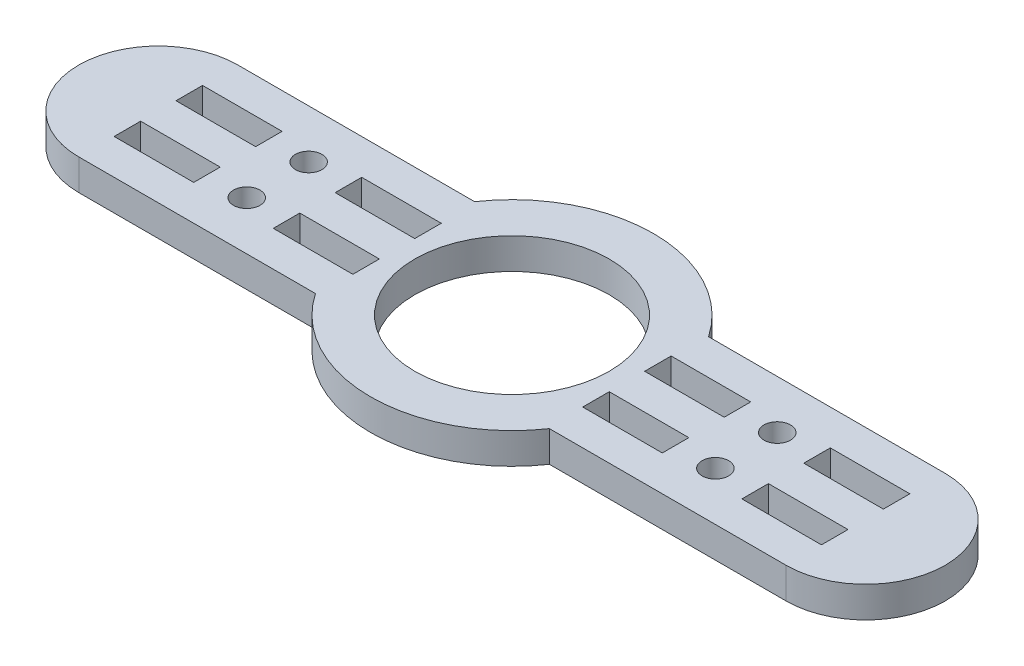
ISO-10303-21;
HEADER;
FILE_DESCRIPTION(('STEP AP214'),'2;1');
FILE_NAME('part.step','',(''),(''),'','','');
FILE_SCHEMA(('AUTOMOTIVE_DESIGN { 1 0 10303 214 1 1 1 1 }'));
ENDSEC;
DATA;
#1=APPLICATION_CONTEXT('core data for automotive mechanical design processes');
#2=APPLICATION_PROTOCOL_DEFINITION('international standard','automotive_design',2000,#1);
#3=PRODUCT_CONTEXT('',#1,'mechanical');
#4=PRODUCT('Part','Part','',(#3));
#5=PRODUCT_RELATED_PRODUCT_CATEGORY('part','',(#4));
#6=PRODUCT_DEFINITION_FORMATION('','',#4);
#7=PRODUCT_DEFINITION_CONTEXT('part definition',#1,'design');
#8=PRODUCT_DEFINITION('design','',#6,#7);
#9=PRODUCT_DEFINITION_SHAPE('','',#8);
#10=(LENGTH_UNIT() NAMED_UNIT(*) SI_UNIT(.MILLI.,.METRE.));
#11=(NAMED_UNIT(*) PLANE_ANGLE_UNIT() SI_UNIT($,.RADIAN.));
#12=(NAMED_UNIT(*) SI_UNIT($,.STERADIAN.) SOLID_ANGLE_UNIT());
#13=UNCERTAINTY_MEASURE_WITH_UNIT(LENGTH_MEASURE(1.E-05),#10,'distance_accuracy_value','');
#14=(GEOMETRIC_REPRESENTATION_CONTEXT(3) GLOBAL_UNCERTAINTY_ASSIGNED_CONTEXT((#13)) GLOBAL_UNIT_ASSIGNED_CONTEXT((#10,
#11,#12)) REPRESENTATION_CONTEXT('',''));
#15=CARTESIAN_POINT('',(0.,0.,0.));
#16=DIRECTION('',(0.,0.,1.));
#17=DIRECTION('',(1.,0.,0.));
#18=AXIS2_PLACEMENT_3D('',#15,#16,#17);
#19=CARTESIAN_POINT('',(31.,3.5,0.));
#20=DIRECTION('',(1.,0.,0.));
#21=DIRECTION('',(0.,0.,-1.));
#22=AXIS2_PLACEMENT_3D('',#19,#20,#21);
#23=PLANE('',#22);
#24=DIRECTION('',(0.,0.,1.));
#25=VECTOR('',#24,1.);
#26=CARTESIAN_POINT('',(31.,0.,0.));
#27=LINE('',#26,#25);
#28=CARTESIAN_POINT('',(31.,0.,-5.));
#29=VERTEX_POINT('',#28);
#30=CARTESIAN_POINT('',(31.,0.,-2.));
#31=VERTEX_POINT('',#30);
#32=EDGE_CURVE('E446',#29,#31,#27,.T.);
#33=ORIENTED_EDGE('',*,*,#32,.F.);
#34=DIRECTION('',(0.,-1.,0.));
#35=VECTOR('',#34,1.);
#36=CARTESIAN_POINT('',(31.,3.5,-5.));
#37=LINE('',#36,#35);
#38=CARTESIAN_POINT('',(31.,3.5,-5.));
#39=VERTEX_POINT('',#38);
#40=EDGE_CURVE('E11',#39,#29,#37,.T.);
#41=ORIENTED_EDGE('',*,*,#40,.F.);
#42=DIRECTION('',(0.,0.,1.));
#43=VECTOR('',#42,1.);
#44=CARTESIAN_POINT('',(31.,3.5,0.));
#45=LINE('',#44,#43);
#46=CARTESIAN_POINT('',(31.,3.5,-2.));
#47=VERTEX_POINT('',#46);
#48=EDGE_CURVE('E319',#39,#47,#45,.T.);
#49=ORIENTED_EDGE('',*,*,#48,.T.);
#50=DIRECTION('',(0.,-1.,0.));
#51=VECTOR('',#50,1.);
#52=CARTESIAN_POINT('',(31.,3.5,-2.));
#53=LINE('',#52,#51);
#54=EDGE_CURVE('E184',#47,#31,#53,.T.);
#55=ORIENTED_EDGE('',*,*,#54,.T.);
#56=EDGE_LOOP('',(#33,#41,#49,#55));
#57=FACE_BOUND('',#56,.T.);
#58=ADVANCED_FACE('F34',(#57),#23,.T.);
#59=CARTESIAN_POINT('',(0.,3.5,-5.));
#60=DIRECTION('',(0.,0.,1.));
#61=DIRECTION('',(1.,0.,0.));
#62=AXIS2_PLACEMENT_3D('',#59,#60,#61);
#63=PLANE('',#62);
#64=DIRECTION('',(-1.,0.,0.));
#65=VECTOR('',#64,1.);
#66=CARTESIAN_POINT('',(0.,0.,-5.));
#67=LINE('',#66,#65);
#68=CARTESIAN_POINT('',(40.,0.,-5.));
#69=VERTEX_POINT('',#68);
#70=EDGE_CURVE('E308',#69,#29,#67,.T.);
#71=ORIENTED_EDGE('',*,*,#70,.F.);
#72=DIRECTION('',(0.,-1.,0.));
#73=VECTOR('',#72,1.);
#74=CARTESIAN_POINT('',(40.,3.5,-5.));
#75=LINE('',#74,#73);
#76=CARTESIAN_POINT('',(40.,3.5,-5.));
#77=VERTEX_POINT('',#76);
#78=EDGE_CURVE('E44',#77,#69,#75,.T.);
#79=ORIENTED_EDGE('',*,*,#78,.F.);
#80=DIRECTION('',(-1.,0.,0.));
#81=VECTOR('',#80,1.);
#82=CARTESIAN_POINT('',(0.,3.5,-5.));
#83=LINE('',#82,#81);
#84=EDGE_CURVE('E306',#77,#39,#83,.T.);
#85=ORIENTED_EDGE('',*,*,#84,.T.);
#86=ORIENTED_EDGE('',*,*,#40,.T.);
#87=EDGE_LOOP('',(#71,#79,#85,#86));
#88=FACE_BOUND('',#87,.T.);
#89=ADVANCED_FACE('F304',(#88),#63,.T.);
#90=CARTESIAN_POINT('',(40.,3.5,0.));
#91=DIRECTION('',(1.,0.,0.));
#92=DIRECTION('',(0.,0.,-1.));
#93=AXIS2_PLACEMENT_3D('',#90,#91,#92);
#94=PLANE('',#93);
#95=DIRECTION('',(0.,0.,1.));
#96=VECTOR('',#95,1.);
#97=CARTESIAN_POINT('',(40.,0.,0.));
#98=LINE('',#97,#96);
#99=CARTESIAN_POINT('',(40.,0.,-2.));
#100=VERTEX_POINT('',#99);
#101=EDGE_CURVE('E449',#69,#100,#98,.T.);
#102=ORIENTED_EDGE('',*,*,#101,.T.);
#103=DIRECTION('',(0.,-1.,0.));
#104=VECTOR('',#103,1.);
#105=CARTESIAN_POINT('',(40.,3.5,-2.));
#106=LINE('',#105,#104);
#107=CARTESIAN_POINT('',(40.,3.5,-2.));
#108=VERTEX_POINT('',#107);
#109=EDGE_CURVE('E311',#108,#100,#106,.T.);
#110=ORIENTED_EDGE('',*,*,#109,.F.);
#111=DIRECTION('',(0.,0.,1.));
#112=VECTOR('',#111,1.);
#113=CARTESIAN_POINT('',(40.,3.5,0.));
#114=LINE('',#113,#112);
#115=EDGE_CURVE('E314',#77,#108,#114,.T.);
#116=ORIENTED_EDGE('',*,*,#115,.F.);
#117=ORIENTED_EDGE('',*,*,#78,.T.);
#118=EDGE_LOOP('',(#102,#110,#116,#117));
#119=FACE_BOUND('',#118,.T.);
#120=ADVANCED_FACE('F315',(#119),#94,.F.);
#121=CARTESIAN_POINT('',(13.,3.5,0.));
#122=DIRECTION('',(1.,0.,0.));
#123=DIRECTION('',(0.,0.,-1.));
#124=AXIS2_PLACEMENT_3D('',#121,#122,#123);
#125=PLANE('',#124);
#126=DIRECTION('',(0.,0.,1.));
#127=VECTOR('',#126,1.);
#128=CARTESIAN_POINT('',(13.,0.,0.));
#129=LINE('',#128,#127);
#130=CARTESIAN_POINT('',(13.,0.,-5.));
#131=VERTEX_POINT('',#130);
#132=CARTESIAN_POINT('',(13.,0.,-2.));
#133=VERTEX_POINT('',#132);
#134=EDGE_CURVE('E434',#131,#133,#129,.T.);
#135=ORIENTED_EDGE('',*,*,#134,.F.);
#136=DIRECTION('',(0.,-1.,0.));
#137=VECTOR('',#136,1.);
#138=CARTESIAN_POINT('',(13.,3.5,-5.));
#139=LINE('',#138,#137);
#140=CARTESIAN_POINT('',(13.,3.5,-5.));
#141=VERTEX_POINT('',#140);
#142=EDGE_CURVE('E457',#141,#131,#139,.T.);
#143=ORIENTED_EDGE('',*,*,#142,.F.);
#144=DIRECTION('',(0.,0.,1.));
#145=VECTOR('',#144,1.);
#146=CARTESIAN_POINT('',(13.,3.5,0.));
#147=LINE('',#146,#145);
#148=CARTESIAN_POINT('',(13.,3.5,-2.));
#149=VERTEX_POINT('',#148);
#150=EDGE_CURVE('E670',#141,#149,#147,.T.);
#151=ORIENTED_EDGE('',*,*,#150,.T.);
#152=DIRECTION('',(0.,-1.,0.));
#153=VECTOR('',#152,1.);
#154=CARTESIAN_POINT('',(13.,3.5,-2.));
#155=LINE('',#154,#153);
#156=EDGE_CURVE('E459',#149,#133,#155,.T.);
#157=ORIENTED_EDGE('',*,*,#156,.T.);
#158=EDGE_LOOP('',(#135,#143,#151,#157));
#159=FACE_BOUND('',#158,.T.);
#160=ADVANCED_FACE('F688',(#159),#125,.T.);
#161=CARTESIAN_POINT('',(0.,3.5,-5.));
#162=DIRECTION('',(0.,0.,1.));
#163=DIRECTION('',(1.,0.,0.));
#164=AXIS2_PLACEMENT_3D('',#161,#162,#163);
#165=PLANE('',#164);
#166=DIRECTION('',(-1.,0.,0.));
#167=VECTOR('',#166,1.);
#168=CARTESIAN_POINT('',(0.,0.,-5.));
#169=LINE('',#168,#167);
#170=CARTESIAN_POINT('',(22.,0.,-5.));
#171=VERTEX_POINT('',#170);
#172=EDGE_CURVE('E437',#171,#131,#169,.T.);
#173=ORIENTED_EDGE('',*,*,#172,.F.);
#174=DIRECTION('',(0.,-1.,0.));
#175=VECTOR('',#174,1.);
#176=CARTESIAN_POINT('',(22.,3.5,-5.));
#177=LINE('',#176,#175);
#178=CARTESIAN_POINT('',(22.,3.5,-5.));
#179=VERTEX_POINT('',#178);
#180=EDGE_CURVE('E465',#179,#171,#177,.T.);
#181=ORIENTED_EDGE('',*,*,#180,.F.);
#182=DIRECTION('',(-1.,0.,0.));
#183=VECTOR('',#182,1.);
#184=CARTESIAN_POINT('',(0.,3.5,-5.));
#185=LINE('',#184,#183);
#186=EDGE_CURVE('E673',#179,#141,#185,.T.);
#187=ORIENTED_EDGE('',*,*,#186,.T.);
#188=ORIENTED_EDGE('',*,*,#142,.T.);
#189=EDGE_LOOP('',(#173,#181,#187,#188));
#190=FACE_BOUND('',#189,.T.);
#191=ADVANCED_FACE('F691',(#190),#165,.T.);
#192=CARTESIAN_POINT('',(22.,3.5,0.));
#193=DIRECTION('',(1.,0.,0.));
#194=DIRECTION('',(0.,0.,-1.));
#195=AXIS2_PLACEMENT_3D('',#192,#193,#194);
#196=PLANE('',#195);
#197=DIRECTION('',(0.,0.,1.));
#198=VECTOR('',#197,1.);
#199=CARTESIAN_POINT('',(22.,0.,0.));
#200=LINE('',#199,#198);
#201=CARTESIAN_POINT('',(22.,0.,-2.));
#202=VERTEX_POINT('',#201);
#203=EDGE_CURVE('E440',#171,#202,#200,.T.);
#204=ORIENTED_EDGE('',*,*,#203,.T.);
#205=DIRECTION('',(0.,-1.,0.));
#206=VECTOR('',#205,1.);
#207=CARTESIAN_POINT('',(22.,3.5,-2.));
#208=LINE('',#207,#206);
#209=CARTESIAN_POINT('',(22.,3.5,-2.));
#210=VERTEX_POINT('',#209);
#211=EDGE_CURVE('E461',#210,#202,#208,.T.);
#212=ORIENTED_EDGE('',*,*,#211,.F.);
#213=DIRECTION('',(0.,0.,1.));
#214=VECTOR('',#213,1.);
#215=CARTESIAN_POINT('',(22.,3.5,0.));
#216=LINE('',#215,#214);
#217=EDGE_CURVE('E676',#179,#210,#216,.T.);
#218=ORIENTED_EDGE('',*,*,#217,.F.);
#219=ORIENTED_EDGE('',*,*,#180,.T.);
#220=EDGE_LOOP('',(#204,#212,#218,#219));
#221=FACE_BOUND('',#220,.T.);
#222=ADVANCED_FACE('F694',(#221),#196,.F.);
#223=CARTESIAN_POINT('',(40.,3.5,0.));
#224=DIRECTION('',(-1.,0.,0.));
#225=DIRECTION('',(0.,0.,1.));
#226=AXIS2_PLACEMENT_3D('',#223,#224,#225);
#227=PLANE('',#226);
#228=DIRECTION('',(0.,0.,-1.));
#229=VECTOR('',#228,1.);
#230=CARTESIAN_POINT('',(40.,0.,0.));
#231=LINE('',#230,#229);
#232=CARTESIAN_POINT('',(40.,0.,5.));
#233=VERTEX_POINT('',#232);
#234=CARTESIAN_POINT('',(40.,0.,2.));
#235=VERTEX_POINT('',#234);
#236=EDGE_CURVE('E422',#233,#235,#231,.T.);
#237=ORIENTED_EDGE('',*,*,#236,.F.);
#238=DIRECTION('',(0.,-1.,0.));
#239=VECTOR('',#238,1.);
#240=CARTESIAN_POINT('',(40.,3.5,5.));
#241=LINE('',#240,#239);
#242=CARTESIAN_POINT('',(40.,3.5,5.));
#243=VERTEX_POINT('',#242);
#244=EDGE_CURVE('E462',#243,#233,#241,.T.);
#245=ORIENTED_EDGE('',*,*,#244,.F.);
#246=DIRECTION('',(0.,0.,-1.));
#247=VECTOR('',#246,1.);
#248=CARTESIAN_POINT('',(40.,3.5,0.));
#249=LINE('',#248,#247);
#250=CARTESIAN_POINT('',(40.,3.5,2.));
#251=VERTEX_POINT('',#250);
#252=EDGE_CURVE('E659',#243,#251,#249,.T.);
#253=ORIENTED_EDGE('',*,*,#252,.T.);
#254=DIRECTION('',(0.,-1.,0.));
#255=VECTOR('',#254,1.);
#256=CARTESIAN_POINT('',(40.,3.5,2.));
#257=LINE('',#256,#255);
#258=EDGE_CURVE('E468',#251,#235,#257,.T.);
#259=ORIENTED_EDGE('',*,*,#258,.T.);
#260=EDGE_LOOP('',(#237,#245,#253,#259));
#261=FACE_BOUND('',#260,.T.);
#262=ADVANCED_FACE('F728',(#261),#227,.T.);
#263=CARTESIAN_POINT('',(0.,3.5,5.));
#264=DIRECTION('',(0.,0.,1.));
#265=DIRECTION('',(1.,0.,0.));
#266=AXIS2_PLACEMENT_3D('',#263,#264,#265);
#267=PLANE('',#266);
#268=DIRECTION('',(-1.,0.,0.));
#269=VECTOR('',#268,1.);
#270=CARTESIAN_POINT('',(0.,0.,5.));
#271=LINE('',#270,#269);
#272=CARTESIAN_POINT('',(31.,0.,5.));
#273=VERTEX_POINT('',#272);
#274=EDGE_CURVE('E425',#233,#273,#271,.T.);
#275=ORIENTED_EDGE('',*,*,#274,.T.);
#276=DIRECTION('',(0.,-1.,0.));
#277=VECTOR('',#276,1.);
#278=CARTESIAN_POINT('',(31.,3.5,5.));
#279=LINE('',#278,#277);
#280=CARTESIAN_POINT('',(31.,3.5,5.));
#281=VERTEX_POINT('',#280);
#282=EDGE_CURVE('E473',#281,#273,#279,.T.);
#283=ORIENTED_EDGE('',*,*,#282,.F.);
#284=DIRECTION('',(-1.,0.,0.));
#285=VECTOR('',#284,1.);
#286=CARTESIAN_POINT('',(0.,3.5,5.));
#287=LINE('',#286,#285);
#288=EDGE_CURVE('E662',#243,#281,#287,.T.);
#289=ORIENTED_EDGE('',*,*,#288,.F.);
#290=ORIENTED_EDGE('',*,*,#244,.T.);
#291=EDGE_LOOP('',(#275,#283,#289,#290));
#292=FACE_BOUND('',#291,.T.);
#293=ADVANCED_FACE('F741',(#292),#267,.F.);
#294=CARTESIAN_POINT('',(31.,3.5,0.));
#295=DIRECTION('',(-1.,0.,0.));
#296=DIRECTION('',(0.,0.,1.));
#297=AXIS2_PLACEMENT_3D('',#294,#295,#296);
#298=PLANE('',#297);
#299=DIRECTION('',(0.,0.,-1.));
#300=VECTOR('',#299,1.);
#301=CARTESIAN_POINT('',(31.,0.,0.));
#302=LINE('',#301,#300);
#303=CARTESIAN_POINT('',(31.,0.,2.));
#304=VERTEX_POINT('',#303);
#305=EDGE_CURVE('E428',#273,#304,#302,.T.);
#306=ORIENTED_EDGE('',*,*,#305,.T.);
#307=DIRECTION('',(0.,-1.,0.));
#308=VECTOR('',#307,1.);
#309=CARTESIAN_POINT('',(31.,3.5,2.));
#310=LINE('',#309,#308);
#311=CARTESIAN_POINT('',(31.,3.5,2.));
#312=VERTEX_POINT('',#311);
#313=EDGE_CURVE('E470',#312,#304,#310,.T.);
#314=ORIENTED_EDGE('',*,*,#313,.F.);
#315=DIRECTION('',(0.,0.,-1.));
#316=VECTOR('',#315,1.);
#317=CARTESIAN_POINT('',(31.,3.5,0.));
#318=LINE('',#317,#316);
#319=EDGE_CURVE('E665',#281,#312,#318,.T.);
#320=ORIENTED_EDGE('',*,*,#319,.F.);
#321=ORIENTED_EDGE('',*,*,#282,.T.);
#322=EDGE_LOOP('',(#306,#314,#320,#321));
#323=FACE_BOUND('',#322,.T.);
#324=ADVANCED_FACE('F737',(#323),#298,.F.);
#325=CARTESIAN_POINT('',(22.,3.5,0.));
#326=DIRECTION('',(-1.,0.,0.));
#327=DIRECTION('',(0.,0.,1.));
#328=AXIS2_PLACEMENT_3D('',#325,#326,#327);
#329=PLANE('',#328);
#330=DIRECTION('',(0.,0.,-1.));
#331=VECTOR('',#330,1.);
#332=CARTESIAN_POINT('',(22.,0.,0.));
#333=LINE('',#332,#331);
#334=CARTESIAN_POINT('',(22.,0.,5.));
#335=VERTEX_POINT('',#334);
#336=CARTESIAN_POINT('',(22.,0.,2.));
#337=VERTEX_POINT('',#336);
#338=EDGE_CURVE('E410',#335,#337,#333,.T.);
#339=ORIENTED_EDGE('',*,*,#338,.F.);
#340=DIRECTION('',(0.,-1.,0.));
#341=VECTOR('',#340,1.);
#342=CARTESIAN_POINT('',(22.,3.5,5.));
#343=LINE('',#342,#341);
#344=CARTESIAN_POINT('',(22.,3.5,5.));
#345=VERTEX_POINT('',#344);
#346=EDGE_CURVE('E471',#345,#335,#343,.T.);
#347=ORIENTED_EDGE('',*,*,#346,.F.);
#348=DIRECTION('',(0.,0.,-1.));
#349=VECTOR('',#348,1.);
#350=CARTESIAN_POINT('',(22.,3.5,0.));
#351=LINE('',#350,#349);
#352=CARTESIAN_POINT('',(22.,3.5,2.));
#353=VERTEX_POINT('',#352);
#354=EDGE_CURVE('E648',#345,#353,#351,.T.);
#355=ORIENTED_EDGE('',*,*,#354,.T.);
#356=DIRECTION('',(0.,-1.,0.));
#357=VECTOR('',#356,1.);
#358=CARTESIAN_POINT('',(22.,3.5,2.));
#359=LINE('',#358,#357);
#360=EDGE_CURVE('E477',#353,#337,#359,.T.);
#361=ORIENTED_EDGE('',*,*,#360,.T.);
#362=EDGE_LOOP('',(#339,#347,#355,#361));
#363=FACE_BOUND('',#362,.T.);
#364=ADVANCED_FACE('F740',(#363),#329,.T.);
#365=CARTESIAN_POINT('',(0.,3.5,5.));
#366=DIRECTION('',(0.,0.,1.));
#367=DIRECTION('',(1.,0.,0.));
#368=AXIS2_PLACEMENT_3D('',#365,#366,#367);
#369=PLANE('',#368);
#370=DIRECTION('',(-1.,0.,0.));
#371=VECTOR('',#370,1.);
#372=CARTESIAN_POINT('',(0.,0.,5.));
#373=LINE('',#372,#371);
#374=CARTESIAN_POINT('',(13.,0.,5.));
#375=VERTEX_POINT('',#374);
#376=EDGE_CURVE('E413',#335,#375,#373,.T.);
#377=ORIENTED_EDGE('',*,*,#376,.T.);
#378=DIRECTION('',(0.,-1.,0.));
#379=VECTOR('',#378,1.);
#380=CARTESIAN_POINT('',(13.,3.5,5.));
#381=LINE('',#380,#379);
#382=CARTESIAN_POINT('',(13.,3.5,5.));
#383=VERTEX_POINT('',#382);
#384=EDGE_CURVE('E482',#383,#375,#381,.T.);
#385=ORIENTED_EDGE('',*,*,#384,.F.);
#386=DIRECTION('',(-1.,0.,0.));
#387=VECTOR('',#386,1.);
#388=CARTESIAN_POINT('',(0.,3.5,5.));
#389=LINE('',#388,#387);
#390=EDGE_CURVE('E651',#345,#383,#389,.T.);
#391=ORIENTED_EDGE('',*,*,#390,.F.);
#392=ORIENTED_EDGE('',*,*,#346,.T.);
#393=EDGE_LOOP('',(#377,#385,#391,#392));
#394=FACE_BOUND('',#393,.T.);
#395=ADVANCED_FACE('F757',(#394),#369,.F.);
#396=CARTESIAN_POINT('',(13.,3.5,0.));
#397=DIRECTION('',(-1.,0.,0.));
#398=DIRECTION('',(0.,0.,1.));
#399=AXIS2_PLACEMENT_3D('',#396,#397,#398);
#400=PLANE('',#399);
#401=DIRECTION('',(0.,0.,-1.));
#402=VECTOR('',#401,1.);
#403=CARTESIAN_POINT('',(13.,0.,0.));
#404=LINE('',#403,#402);
#405=CARTESIAN_POINT('',(13.,0.,2.));
#406=VERTEX_POINT('',#405);
#407=EDGE_CURVE('E416',#375,#406,#404,.T.);
#408=ORIENTED_EDGE('',*,*,#407,.T.);
#409=DIRECTION('',(0.,-1.,0.));
#410=VECTOR('',#409,1.);
#411=CARTESIAN_POINT('',(13.,3.5,2.));
#412=LINE('',#411,#410);
#413=CARTESIAN_POINT('',(13.,3.5,2.));
#414=VERTEX_POINT('',#413);
#415=EDGE_CURVE('E479',#414,#406,#412,.T.);
#416=ORIENTED_EDGE('',*,*,#415,.F.);
#417=DIRECTION('',(0.,0.,-1.));
#418=VECTOR('',#417,1.);
#419=CARTESIAN_POINT('',(13.,3.5,0.));
#420=LINE('',#419,#418);
#421=EDGE_CURVE('E654',#383,#414,#420,.T.);
#422=ORIENTED_EDGE('',*,*,#421,.F.);
#423=ORIENTED_EDGE('',*,*,#384,.T.);
#424=EDGE_LOOP('',(#408,#416,#422,#423));
#425=FACE_BOUND('',#424,.T.);
#426=ADVANCED_FACE('F753',(#425),#400,.F.);
#427=CARTESIAN_POINT('',(-31.,3.5,0.));
#428=DIRECTION('',(-1.,0.,0.));
#429=DIRECTION('',(0.,0.,1.));
#430=AXIS2_PLACEMENT_3D('',#427,#428,#429);
#431=PLANE('',#430);
#432=DIRECTION('',(0.,0.,-1.));
#433=VECTOR('',#432,1.);
#434=CARTESIAN_POINT('',(-31.,0.,0.));
#435=LINE('',#434,#433);
#436=CARTESIAN_POINT('',(-31.,0.,5.));
#437=VERTEX_POINT('',#436);
#438=CARTESIAN_POINT('',(-31.,0.,2.));
#439=VERTEX_POINT('',#438);
#440=EDGE_CURVE('E392',#437,#439,#435,.T.);
#441=ORIENTED_EDGE('',*,*,#440,.F.);
#442=DIRECTION('',(0.,-1.,0.));
#443=VECTOR('',#442,1.);
#444=CARTESIAN_POINT('',(-31.,3.5,5.));
#445=LINE('',#444,#443);
#446=CARTESIAN_POINT('',(-31.,3.5,5.));
#447=VERTEX_POINT('',#446);
#448=EDGE_CURVE('E480',#447,#437,#445,.T.);
#449=ORIENTED_EDGE('',*,*,#448,.F.);
#450=DIRECTION('',(0.,0.,-1.));
#451=VECTOR('',#450,1.);
#452=CARTESIAN_POINT('',(-31.,3.5,0.));
#453=LINE('',#452,#451);
#454=CARTESIAN_POINT('',(-31.,3.5,2.));
#455=VERTEX_POINT('',#454);
#456=EDGE_CURVE('E631',#447,#455,#453,.T.);
#457=ORIENTED_EDGE('',*,*,#456,.T.);
#458=DIRECTION('',(0.,-1.,0.));
#459=VECTOR('',#458,1.);
#460=CARTESIAN_POINT('',(-31.,3.5,2.));
#461=LINE('',#460,#459);
#462=EDGE_CURVE('E486',#455,#439,#461,.T.);
#463=ORIENTED_EDGE('',*,*,#462,.T.);
#464=EDGE_LOOP('',(#441,#449,#457,#463));
#465=FACE_BOUND('',#464,.T.);
#466=ADVANCED_FACE('F756',(#465),#431,.T.);
#467=CARTESIAN_POINT('',(0.,3.5,5.));
#468=DIRECTION('',(0.,0.,-1.));
#469=DIRECTION('',(-1.,0.,0.));
#470=AXIS2_PLACEMENT_3D('',#467,#468,#469);
#471=PLANE('',#470);
#472=DIRECTION('',(1.,0.,0.));
#473=VECTOR('',#472,1.);
#474=CARTESIAN_POINT('',(0.,0.,5.));
#475=LINE('',#474,#473);
#476=CARTESIAN_POINT('',(-40.,0.,5.));
#477=VERTEX_POINT('',#476);
#478=EDGE_CURVE('E395',#477,#437,#475,.T.);
#479=ORIENTED_EDGE('',*,*,#478,.F.);
#480=DIRECTION('',(0.,-1.,0.));
#481=VECTOR('',#480,1.);
#482=CARTESIAN_POINT('',(-40.,3.5,5.));
#483=LINE('',#482,#481);
#484=CARTESIAN_POINT('',(-40.,3.5,5.));
#485=VERTEX_POINT('',#484);
#486=EDGE_CURVE('E492',#485,#477,#483,.T.);
#487=ORIENTED_EDGE('',*,*,#486,.F.);
#488=DIRECTION('',(1.,0.,0.));
#489=VECTOR('',#488,1.);
#490=CARTESIAN_POINT('',(0.,3.5,5.));
#491=LINE('',#490,#489);
#492=EDGE_CURVE('E634',#485,#447,#491,.T.);
#493=ORIENTED_EDGE('',*,*,#492,.T.);
#494=ORIENTED_EDGE('',*,*,#448,.T.);
#495=EDGE_LOOP('',(#479,#487,#493,#494));
#496=FACE_BOUND('',#495,.T.);
#497=ADVANCED_FACE('F781',(#496),#471,.T.);
#498=CARTESIAN_POINT('',(-40.,3.5,0.));
#499=DIRECTION('',(-1.,0.,0.));
#500=DIRECTION('',(0.,0.,1.));
#501=AXIS2_PLACEMENT_3D('',#498,#499,#500);
#502=PLANE('',#501);
#503=DIRECTION('',(0.,0.,-1.));
#504=VECTOR('',#503,1.);
#505=CARTESIAN_POINT('',(-40.,0.,0.));
#506=LINE('',#505,#504);
#507=CARTESIAN_POINT('',(-40.,0.,2.));
#508=VERTEX_POINT('',#507);
#509=EDGE_CURVE('E398',#477,#508,#506,.T.);
#510=ORIENTED_EDGE('',*,*,#509,.T.);
#511=DIRECTION('',(0.,-1.,0.));
#512=VECTOR('',#511,1.);
#513=CARTESIAN_POINT('',(-40.,3.5,2.));
#514=LINE('',#513,#512);
#515=CARTESIAN_POINT('',(-40.,3.5,2.));
#516=VERTEX_POINT('',#515);
#517=EDGE_CURVE('E488',#516,#508,#514,.T.);
#518=ORIENTED_EDGE('',*,*,#517,.F.);
#519=DIRECTION('',(0.,0.,-1.));
#520=VECTOR('',#519,1.);
#521=CARTESIAN_POINT('',(-40.,3.5,0.));
#522=LINE('',#521,#520);
#523=EDGE_CURVE('E637',#485,#516,#522,.T.);
#524=ORIENTED_EDGE('',*,*,#523,.F.);
#525=ORIENTED_EDGE('',*,*,#486,.T.);
#526=EDGE_LOOP('',(#510,#518,#524,#525));
#527=FACE_BOUND('',#526,.T.);
#528=ADVANCED_FACE('F777',(#527),#502,.F.);
#529=CARTESIAN_POINT('',(-13.,3.5,0.));
#530=DIRECTION('',(-1.,0.,0.));
#531=DIRECTION('',(0.,0.,1.));
#532=AXIS2_PLACEMENT_3D('',#529,#530,#531);
#533=PLANE('',#532);
#534=DIRECTION('',(0.,0.,-1.));
#535=VECTOR('',#534,1.);
#536=CARTESIAN_POINT('',(-13.,0.,0.));
#537=LINE('',#536,#535);
#538=CARTESIAN_POINT('',(-13.,0.,5.));
#539=VERTEX_POINT('',#538);
#540=CARTESIAN_POINT('',(-13.,0.,2.));
#541=VERTEX_POINT('',#540);
#542=EDGE_CURVE('E380',#539,#541,#537,.T.);
#543=ORIENTED_EDGE('',*,*,#542,.F.);
#544=DIRECTION('',(0.,-1.,0.));
#545=VECTOR('',#544,1.);
#546=CARTESIAN_POINT('',(-13.,3.5,5.));
#547=LINE('',#546,#545);
#548=CARTESIAN_POINT('',(-13.,3.5,5.));
#549=VERTEX_POINT('',#548);
#550=EDGE_CURVE('E489',#549,#539,#547,.T.);
#551=ORIENTED_EDGE('',*,*,#550,.F.);
#552=DIRECTION('',(0.,0.,-1.));
#553=VECTOR('',#552,1.);
#554=CARTESIAN_POINT('',(-13.,3.5,0.));
#555=LINE('',#554,#553);
#556=CARTESIAN_POINT('',(-13.,3.5,2.));
#557=VERTEX_POINT('',#556);
#558=EDGE_CURVE('E620',#549,#557,#555,.T.);
#559=ORIENTED_EDGE('',*,*,#558,.T.);
#560=DIRECTION('',(0.,-1.,0.));
#561=VECTOR('',#560,1.);
#562=CARTESIAN_POINT('',(-13.,3.5,2.));
#563=LINE('',#562,#561);
#564=EDGE_CURVE('E495',#557,#541,#563,.T.);
#565=ORIENTED_EDGE('',*,*,#564,.T.);
#566=EDGE_LOOP('',(#543,#551,#559,#565));
#567=FACE_BOUND('',#566,.T.);
#568=ADVANCED_FACE('F780',(#567),#533,.T.);
#569=CARTESIAN_POINT('',(0.,3.5,5.));
#570=DIRECTION('',(0.,0.,-1.));
#571=DIRECTION('',(-1.,0.,0.));
#572=AXIS2_PLACEMENT_3D('',#569,#570,#571);
#573=PLANE('',#572);
#574=DIRECTION('',(1.,0.,0.));
#575=VECTOR('',#574,1.);
#576=CARTESIAN_POINT('',(0.,0.,5.));
#577=LINE('',#576,#575);
#578=CARTESIAN_POINT('',(-22.,0.,5.));
#579=VERTEX_POINT('',#578);
#580=EDGE_CURVE('E383',#579,#539,#577,.T.);
#581=ORIENTED_EDGE('',*,*,#580,.F.);
#582=DIRECTION('',(0.,-1.,0.));
#583=VECTOR('',#582,1.);
#584=CARTESIAN_POINT('',(-22.,3.5,5.));
#585=LINE('',#584,#583);
#586=CARTESIAN_POINT('',(-22.,3.5,5.));
#587=VERTEX_POINT('',#586);
#588=EDGE_CURVE('E501',#587,#579,#585,.T.);
#589=ORIENTED_EDGE('',*,*,#588,.F.);
#590=DIRECTION('',(1.,0.,0.));
#591=VECTOR('',#590,1.);
#592=CARTESIAN_POINT('',(0.,3.5,5.));
#593=LINE('',#592,#591);
#594=EDGE_CURVE('E623',#587,#549,#593,.T.);
#595=ORIENTED_EDGE('',*,*,#594,.T.);
#596=ORIENTED_EDGE('',*,*,#550,.T.);
#597=EDGE_LOOP('',(#581,#589,#595,#596));
#598=FACE_BOUND('',#597,.T.);
#599=ADVANCED_FACE('F797',(#598),#573,.T.);
#600=CARTESIAN_POINT('',(-22.,3.5,0.));
#601=DIRECTION('',(-1.,0.,0.));
#602=DIRECTION('',(0.,0.,1.));
#603=AXIS2_PLACEMENT_3D('',#600,#601,#602);
#604=PLANE('',#603);
#605=DIRECTION('',(0.,0.,-1.));
#606=VECTOR('',#605,1.);
#607=CARTESIAN_POINT('',(-22.,0.,0.));
#608=LINE('',#607,#606);
#609=CARTESIAN_POINT('',(-22.,0.,2.));
#610=VERTEX_POINT('',#609);
#611=EDGE_CURVE('E386',#579,#610,#608,.T.);
#612=ORIENTED_EDGE('',*,*,#611,.T.);
#613=DIRECTION('',(0.,-1.,0.));
#614=VECTOR('',#613,1.);
#615=CARTESIAN_POINT('',(-22.,3.5,2.));
#616=LINE('',#615,#614);
#617=CARTESIAN_POINT('',(-22.,3.5,2.));
#618=VERTEX_POINT('',#617);
#619=EDGE_CURVE('E497',#618,#610,#616,.T.);
#620=ORIENTED_EDGE('',*,*,#619,.F.);
#621=DIRECTION('',(0.,0.,-1.));
#622=VECTOR('',#621,1.);
#623=CARTESIAN_POINT('',(-22.,3.5,0.));
#624=LINE('',#623,#622);
#625=EDGE_CURVE('E626',#587,#618,#624,.T.);
#626=ORIENTED_EDGE('',*,*,#625,.F.);
#627=ORIENTED_EDGE('',*,*,#588,.T.);
#628=EDGE_LOOP('',(#612,#620,#626,#627));
#629=FACE_BOUND('',#628,.T.);
#630=ADVANCED_FACE('F793',(#629),#604,.F.);
#631=CARTESIAN_POINT('',(-40.,3.5,0.));
#632=DIRECTION('',(1.,0.,0.));
#633=DIRECTION('',(0.,0.,-1.));
#634=AXIS2_PLACEMENT_3D('',#631,#632,#633);
#635=PLANE('',#634);
#636=DIRECTION('',(0.,0.,1.));
#637=VECTOR('',#636,1.);
#638=CARTESIAN_POINT('',(-40.,0.,0.));
#639=LINE('',#638,#637);
#640=CARTESIAN_POINT('',(-40.,0.,-5.));
#641=VERTEX_POINT('',#640);
#642=CARTESIAN_POINT('',(-40.,0.,-2.));
#643=VERTEX_POINT('',#642);
#644=EDGE_CURVE('E368',#641,#643,#639,.T.);
#645=ORIENTED_EDGE('',*,*,#644,.F.);
#646=DIRECTION('',(0.,-1.,0.));
#647=VECTOR('',#646,1.);
#648=CARTESIAN_POINT('',(-40.,3.5,-5.));
#649=LINE('',#648,#647);
#650=CARTESIAN_POINT('',(-40.,3.5,-5.));
#651=VERTEX_POINT('',#650);
#652=EDGE_CURVE('E498',#651,#641,#649,.T.);
#653=ORIENTED_EDGE('',*,*,#652,.F.);
#654=DIRECTION('',(0.,0.,1.));
#655=VECTOR('',#654,1.);
#656=CARTESIAN_POINT('',(-40.,3.5,0.));
#657=LINE('',#656,#655);
#658=CARTESIAN_POINT('',(-40.,3.5,-2.));
#659=VERTEX_POINT('',#658);
#660=EDGE_CURVE('E609',#651,#659,#657,.T.);
#661=ORIENTED_EDGE('',*,*,#660,.T.);
#662=DIRECTION('',(0.,-1.,0.));
#663=VECTOR('',#662,1.);
#664=CARTESIAN_POINT('',(-40.,3.5,-2.));
#665=LINE('',#664,#663);
#666=EDGE_CURVE('E504',#659,#643,#665,.T.);
#667=ORIENTED_EDGE('',*,*,#666,.T.);
#668=EDGE_LOOP('',(#645,#653,#661,#667));
#669=FACE_BOUND('',#668,.T.);
#670=ADVANCED_FACE('F796',(#669),#635,.T.);
#671=CARTESIAN_POINT('',(0.,3.5,-5.));
#672=DIRECTION('',(0.,0.,-1.));
#673=DIRECTION('',(-1.,0.,0.));
#674=AXIS2_PLACEMENT_3D('',#671,#672,#673);
#675=PLANE('',#674);
#676=DIRECTION('',(1.,0.,0.));
#677=VECTOR('',#676,1.);
#678=CARTESIAN_POINT('',(0.,0.,-5.));
#679=LINE('',#678,#677);
#680=CARTESIAN_POINT('',(-31.,0.,-5.));
#681=VERTEX_POINT('',#680);
#682=EDGE_CURVE('E371',#641,#681,#679,.T.);
#683=ORIENTED_EDGE('',*,*,#682,.T.);
#684=DIRECTION('',(0.,-1.,0.));
#685=VECTOR('',#684,1.);
#686=CARTESIAN_POINT('',(-31.,3.5,-5.));
#687=LINE('',#686,#685);
#688=CARTESIAN_POINT('',(-31.,3.5,-5.));
#689=VERTEX_POINT('',#688);
#690=EDGE_CURVE('E509',#689,#681,#687,.T.);
#691=ORIENTED_EDGE('',*,*,#690,.F.);
#692=DIRECTION('',(1.,0.,0.));
#693=VECTOR('',#692,1.);
#694=CARTESIAN_POINT('',(0.,3.5,-5.));
#695=LINE('',#694,#693);
#696=EDGE_CURVE('E612',#651,#689,#695,.T.);
#697=ORIENTED_EDGE('',*,*,#696,.F.);
#698=ORIENTED_EDGE('',*,*,#652,.T.);
#699=EDGE_LOOP('',(#683,#691,#697,#698));
#700=FACE_BOUND('',#699,.T.);
#701=ADVANCED_FACE('F813',(#700),#675,.F.);
#702=CARTESIAN_POINT('',(-31.,3.5,0.));
#703=DIRECTION('',(1.,0.,0.));
#704=DIRECTION('',(0.,0.,-1.));
#705=AXIS2_PLACEMENT_3D('',#702,#703,#704);
#706=PLANE('',#705);
#707=DIRECTION('',(0.,0.,1.));
#708=VECTOR('',#707,1.);
#709=CARTESIAN_POINT('',(-31.,0.,0.));
#710=LINE('',#709,#708);
#711=CARTESIAN_POINT('',(-31.,0.,-2.));
#712=VERTEX_POINT('',#711);
#713=EDGE_CURVE('E374',#681,#712,#710,.T.);
#714=ORIENTED_EDGE('',*,*,#713,.T.);
#715=DIRECTION('',(0.,-1.,0.));
#716=VECTOR('',#715,1.);
#717=CARTESIAN_POINT('',(-31.,3.5,-2.));
#718=LINE('',#717,#716);
#719=CARTESIAN_POINT('',(-31.,3.5,-2.));
#720=VERTEX_POINT('',#719);
#721=EDGE_CURVE('E506',#720,#712,#718,.T.);
#722=ORIENTED_EDGE('',*,*,#721,.F.);
#723=DIRECTION('',(0.,0.,1.));
#724=VECTOR('',#723,1.);
#725=CARTESIAN_POINT('',(-31.,3.5,0.));
#726=LINE('',#725,#724);
#727=EDGE_CURVE('E615',#689,#720,#726,.T.);
#728=ORIENTED_EDGE('',*,*,#727,.F.);
#729=ORIENTED_EDGE('',*,*,#690,.T.);
#730=EDGE_LOOP('',(#714,#722,#728,#729));
#731=FACE_BOUND('',#730,.T.);
#732=ADVANCED_FACE('F809',(#731),#706,.F.);
#733=CARTESIAN_POINT('',(-22.,3.5,0.));
#734=DIRECTION('',(1.,0.,0.));
#735=DIRECTION('',(0.,0.,-1.));
#736=AXIS2_PLACEMENT_3D('',#733,#734,#735);
#737=PLANE('',#736);
#738=DIRECTION('',(0.,0.,1.));
#739=VECTOR('',#738,1.);
#740=CARTESIAN_POINT('',(-22.,0.,0.));
#741=LINE('',#740,#739);
#742=CARTESIAN_POINT('',(-22.,0.,-5.));
#743=VERTEX_POINT('',#742);
#744=CARTESIAN_POINT('',(-22.,0.,-2.));
#745=VERTEX_POINT('',#744);
#746=EDGE_CURVE('E356',#743,#745,#741,.T.);
#747=ORIENTED_EDGE('',*,*,#746,.F.);
#748=DIRECTION('',(0.,-1.,0.));
#749=VECTOR('',#748,1.);
#750=CARTESIAN_POINT('',(-22.,3.5,-5.));
#751=LINE('',#750,#749);
#752=CARTESIAN_POINT('',(-22.,3.5,-5.));
#753=VERTEX_POINT('',#752);
#754=EDGE_CURVE('E507',#753,#743,#751,.T.);
#755=ORIENTED_EDGE('',*,*,#754,.F.);
#756=DIRECTION('',(0.,0.,1.));
#757=VECTOR('',#756,1.);
#758=CARTESIAN_POINT('',(-22.,3.5,0.));
#759=LINE('',#758,#757);
#760=CARTESIAN_POINT('',(-22.,3.5,-2.));
#761=VERTEX_POINT('',#760);
#762=EDGE_CURVE('E598',#753,#761,#759,.T.);
#763=ORIENTED_EDGE('',*,*,#762,.T.);
#764=DIRECTION('',(0.,-1.,0.));
#765=VECTOR('',#764,1.);
#766=CARTESIAN_POINT('',(-22.,3.5,-2.));
#767=LINE('',#766,#765);
#768=EDGE_CURVE('E513',#761,#745,#767,.T.);
#769=ORIENTED_EDGE('',*,*,#768,.T.);
#770=EDGE_LOOP('',(#747,#755,#763,#769));
#771=FACE_BOUND('',#770,.T.);
#772=ADVANCED_FACE('F812',(#771),#737,.T.);
#773=CARTESIAN_POINT('',(0.,3.5,-5.));
#774=DIRECTION('',(0.,0.,-1.));
#775=DIRECTION('',(-1.,0.,0.));
#776=AXIS2_PLACEMENT_3D('',#773,#774,#775);
#777=PLANE('',#776);
#778=DIRECTION('',(1.,0.,0.));
#779=VECTOR('',#778,1.);
#780=CARTESIAN_POINT('',(0.,0.,-5.));
#781=LINE('',#780,#779);
#782=CARTESIAN_POINT('',(-13.,0.,-5.));
#783=VERTEX_POINT('',#782);
#784=EDGE_CURVE('E359',#743,#783,#781,.T.);
#785=ORIENTED_EDGE('',*,*,#784,.T.);
#786=DIRECTION('',(0.,-1.,0.));
#787=VECTOR('',#786,1.);
#788=CARTESIAN_POINT('',(-13.,3.5,-5.));
#789=LINE('',#788,#787);
#790=CARTESIAN_POINT('',(-13.,3.5,-5.));
#791=VERTEX_POINT('',#790);
#792=EDGE_CURVE('E517',#791,#783,#789,.T.);
#793=ORIENTED_EDGE('',*,*,#792,.F.);
#794=DIRECTION('',(1.,0.,0.));
#795=VECTOR('',#794,1.);
#796=CARTESIAN_POINT('',(0.,3.5,-5.));
#797=LINE('',#796,#795);
#798=EDGE_CURVE('E601',#753,#791,#797,.T.);
#799=ORIENTED_EDGE('',*,*,#798,.F.);
#800=ORIENTED_EDGE('',*,*,#754,.T.);
#801=EDGE_LOOP('',(#785,#793,#799,#800));
#802=FACE_BOUND('',#801,.T.);
#803=ADVANCED_FACE('F828',(#802),#777,.F.);
#804=CARTESIAN_POINT('',(-13.,3.5,0.));
#805=DIRECTION('',(1.,0.,0.));
#806=DIRECTION('',(0.,0.,-1.));
#807=AXIS2_PLACEMENT_3D('',#804,#805,#806);
#808=PLANE('',#807);
#809=DIRECTION('',(0.,0.,1.));
#810=VECTOR('',#809,1.);
#811=CARTESIAN_POINT('',(-13.,0.,0.));
#812=LINE('',#811,#810);
#813=CARTESIAN_POINT('',(-13.,0.,-2.));
#814=VERTEX_POINT('',#813);
#815=EDGE_CURVE('E362',#783,#814,#812,.T.);
#816=ORIENTED_EDGE('',*,*,#815,.T.);
#817=DIRECTION('',(0.,-1.,0.));
#818=VECTOR('',#817,1.);
#819=CARTESIAN_POINT('',(-13.,3.5,-2.));
#820=LINE('',#819,#818);
#821=CARTESIAN_POINT('',(-13.,3.5,-2.));
#822=VERTEX_POINT('',#821);
#823=EDGE_CURVE('E515',#822,#814,#820,.T.);
#824=ORIENTED_EDGE('',*,*,#823,.F.);
#825=DIRECTION('',(0.,0.,1.));
#826=VECTOR('',#825,1.);
#827=CARTESIAN_POINT('',(-13.,3.5,0.));
#828=LINE('',#827,#826);
#829=EDGE_CURVE('E604',#791,#822,#828,.T.);
#830=ORIENTED_EDGE('',*,*,#829,.F.);
#831=ORIENTED_EDGE('',*,*,#792,.T.);
#832=EDGE_LOOP('',(#816,#824,#830,#831));
#833=FACE_BOUND('',#832,.T.);
#834=ADVANCED_FACE('F825',(#833),#808,.F.);
#835=CARTESIAN_POINT('',(0.,3.5,-9.00000000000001));
#836=DIRECTION('',(0.,0.,-1.));
#837=DIRECTION('',(-1.,0.,0.));
#838=AXIS2_PLACEMENT_3D('',#835,#836,#837);
#839=PLANE('',#838);
#840=DIRECTION('',(1.,0.,0.));
#841=VECTOR('',#840,1.);
#842=CARTESIAN_POINT('',(0.,0.,-9.00000000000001));
#843=LINE('',#842,#841);
#844=CARTESIAN_POINT('',(13.2287565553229,0.,-9.00000000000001));
#845=VERTEX_POINT('',#844);
#846=CARTESIAN_POINT('',(40.,0.,-9.00000000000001));
#847=VERTEX_POINT('',#846);
#848=EDGE_CURVE('E330',#845,#847,#843,.T.);
#849=ORIENTED_EDGE('',*,*,#848,.F.);
#850=DIRECTION('',(0.,-1.,0.));
#851=VECTOR('',#850,1.);
#852=CARTESIAN_POINT('',(13.2287565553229,3.5,-9.00000000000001));
#853=LINE('',#852,#851);
#854=CARTESIAN_POINT('',(13.2287565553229,3.5,-9.00000000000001));
#855=VERTEX_POINT('',#854);
#856=EDGE_CURVE('E38',#855,#845,#853,.T.);
#857=ORIENTED_EDGE('',*,*,#856,.F.);
#858=DIRECTION('',(1.,0.,0.));
#859=VECTOR('',#858,1.);
#860=CARTESIAN_POINT('',(0.,3.5,-9.00000000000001));
#861=LINE('',#860,#859);
#862=CARTESIAN_POINT('',(40.,3.5,-9.00000000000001));
#863=VERTEX_POINT('',#862);
#864=EDGE_CURVE('E455',#855,#863,#861,.T.);
#865=ORIENTED_EDGE('',*,*,#864,.T.);
#866=DIRECTION('',(0.,-1.,0.));
#867=VECTOR('',#866,1.);
#868=CARTESIAN_POINT('',(40.,3.5,-9.00000000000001));
#869=LINE('',#868,#867);
#870=EDGE_CURVE('E329',#863,#847,#869,.T.);
#871=ORIENTED_EDGE('',*,*,#870,.T.);
#872=EDGE_LOOP('',(#849,#857,#865,#871));
#873=FACE_BOUND('',#872,.T.);
#874=ADVANCED_FACE('F36',(#873),#839,.T.);
#875=CARTESIAN_POINT('',(0.,3.5,0.));
#876=DIRECTION('',(0.,-1.,0.));
#877=DIRECTION('',(0.,0.,-1.));
#878=AXIS2_PLACEMENT_3D('',#875,#876,#877);
#879=CYLINDRICAL_SURFACE('',#878,16.);
#880=CARTESIAN_POINT('',(0.,0.,0.));
#881=DIRECTION('',(0.,1.,0.));
#882=DIRECTION('',(0.,0.,1.));
#883=AXIS2_PLACEMENT_3D('',#880,#881,#882);
#884=CIRCLE('',#883,16.);
#885=CARTESIAN_POINT('',(-13.228756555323,0.,-9.00000000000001));
#886=VERTEX_POINT('',#885);
#887=EDGE_CURVE('E333',#845,#886,#884,.T.);
#888=ORIENTED_EDGE('',*,*,#887,.T.);
#889=DIRECTION('',(0.,-1.,0.));
#890=VECTOR('',#889,1.);
#891=CARTESIAN_POINT('',(-13.228756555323,3.5,-9.00000000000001));
#892=LINE('',#891,#890);
#893=CARTESIAN_POINT('',(-13.228756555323,3.5,-9.00000000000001));
#894=VERTEX_POINT('',#893);
#895=EDGE_CURVE('E535',#894,#886,#892,.T.);
#896=ORIENTED_EDGE('',*,*,#895,.F.);
#897=CARTESIAN_POINT('',(0.,3.5,0.));
#898=DIRECTION('',(0.,1.,0.));
#899=DIRECTION('',(0.,0.,1.));
#900=AXIS2_PLACEMENT_3D('',#897,#898,#899);
#901=CIRCLE('',#900,16.);
#902=EDGE_CURVE('E543',#855,#894,#901,.T.);
#903=ORIENTED_EDGE('',*,*,#902,.F.);
#904=ORIENTED_EDGE('',*,*,#856,.T.);
#905=EDGE_LOOP('',(#888,#896,#903,#904));
#906=FACE_BOUND('',#905,.T.);
#907=ADVANCED_FACE('F542',(#906),#879,.T.);
#908=CARTESIAN_POINT('',(0.,3.5,-9.00000000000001));
#909=DIRECTION('',(0.,0.,-1.));
#910=DIRECTION('',(-1.,0.,0.));
#911=AXIS2_PLACEMENT_3D('',#908,#909,#910);
#912=PLANE('',#911);
#913=DIRECTION('',(1.,0.,0.));
#914=VECTOR('',#913,1.);
#915=CARTESIAN_POINT('',(0.,0.,-9.00000000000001));
#916=LINE('',#915,#914);
#917=CARTESIAN_POINT('',(-40.,0.,-9.));
#918=VERTEX_POINT('',#917);
#919=EDGE_CURVE('E336',#918,#886,#916,.T.);
#920=ORIENTED_EDGE('',*,*,#919,.F.);
#921=DIRECTION('',(0.,-1.,0.));
#922=VECTOR('',#921,1.);
#923=CARTESIAN_POINT('',(-40.,3.5,-9.));
#924=LINE('',#923,#922);
#925=CARTESIAN_POINT('',(-40.,3.5,-9.));
#926=VERTEX_POINT('',#925);
#927=EDGE_CURVE('E534',#926,#918,#924,.T.);
#928=ORIENTED_EDGE('',*,*,#927,.F.);
#929=DIRECTION('',(1.,0.,0.));
#930=VECTOR('',#929,1.);
#931=CARTESIAN_POINT('',(0.,3.5,-9.00000000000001));
#932=LINE('',#931,#930);
#933=EDGE_CURVE('E577',#926,#894,#932,.T.);
#934=ORIENTED_EDGE('',*,*,#933,.T.);
#935=ORIENTED_EDGE('',*,*,#895,.T.);
#936=EDGE_LOOP('',(#920,#928,#934,#935));
#937=FACE_BOUND('',#936,.T.);
#938=ADVANCED_FACE('F574',(#937),#912,.T.);
#939=CARTESIAN_POINT('',(-40.,3.5,0.));
#940=DIRECTION('',(0.,-1.,0.));
#941=DIRECTION('',(0.,0.,-1.));
#942=AXIS2_PLACEMENT_3D('',#939,#940,#941);
#943=CYLINDRICAL_SURFACE('',#942,9.);
#944=CARTESIAN_POINT('',(-40.,0.,0.));
#945=DIRECTION('',(0.,1.,0.));
#946=DIRECTION('',(0.,0.,1.));
#947=AXIS2_PLACEMENT_3D('',#944,#945,#946);
#948=CIRCLE('',#947,9.);
#949=CARTESIAN_POINT('',(-40.,0.,9.));
#950=VERTEX_POINT('',#949);
#951=EDGE_CURVE('E339',#918,#950,#948,.T.);
#952=ORIENTED_EDGE('',*,*,#951,.T.);
#953=DIRECTION('',(0.,-1.,0.));
#954=VECTOR('',#953,1.);
#955=CARTESIAN_POINT('',(-40.,3.5,9.));
#956=LINE('',#955,#954);
#957=CARTESIAN_POINT('',(-40.,3.5,9.));
#958=VERTEX_POINT('',#957);
#959=EDGE_CURVE('E531',#958,#950,#956,.T.);
#960=ORIENTED_EDGE('',*,*,#959,.F.);
#961=CARTESIAN_POINT('',(-40.,3.5,0.));
#962=DIRECTION('',(0.,1.,0.));
#963=DIRECTION('',(0.,0.,1.));
#964=AXIS2_PLACEMENT_3D('',#961,#962,#963);
#965=CIRCLE('',#964,9.);
#966=EDGE_CURVE('E578',#926,#958,#965,.T.);
#967=ORIENTED_EDGE('',*,*,#966,.F.);
#968=ORIENTED_EDGE('',*,*,#927,.T.);
#969=EDGE_LOOP('',(#952,#960,#967,#968));
#970=FACE_BOUND('',#969,.T.);
#971=ADVANCED_FACE('F579',(#970),#943,.T.);
#972=CARTESIAN_POINT('',(0.,3.5,8.99999999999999));
#973=DIRECTION('',(0.,0.,-1.));
#974=DIRECTION('',(-1.,0.,0.));
#975=AXIS2_PLACEMENT_3D('',#972,#973,#974);
#976=PLANE('',#975);
#977=DIRECTION('',(1.,0.,0.));
#978=VECTOR('',#977,1.);
#979=CARTESIAN_POINT('',(0.,0.,8.99999999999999));
#980=LINE('',#979,#978);
#981=CARTESIAN_POINT('',(-13.228756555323,0.,9.));
#982=VERTEX_POINT('',#981);
#983=EDGE_CURVE('E341',#950,#982,#980,.T.);
#984=ORIENTED_EDGE('',*,*,#983,.T.);
#985=DIRECTION('',(0.,-1.,0.));
#986=VECTOR('',#985,1.);
#987=CARTESIAN_POINT('',(-13.228756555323,3.5,9.));
#988=LINE('',#987,#986);
#989=CARTESIAN_POINT('',(-13.228756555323,3.5,9.));
#990=VERTEX_POINT('',#989);
#991=EDGE_CURVE('E528',#990,#982,#988,.T.);
#992=ORIENTED_EDGE('',*,*,#991,.F.);
#993=DIRECTION('',(1.,0.,0.));
#994=VECTOR('',#993,1.);
#995=CARTESIAN_POINT('',(0.,3.5,8.99999999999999));
#996=LINE('',#995,#994);
#997=EDGE_CURVE('E571',#958,#990,#996,.T.);
#998=ORIENTED_EDGE('',*,*,#997,.F.);
#999=ORIENTED_EDGE('',*,*,#959,.T.);
#1000=EDGE_LOOP('',(#984,#992,#998,#999));
#1001=FACE_BOUND('',#1000,.T.);
#1002=ADVANCED_FACE('F570',(#1001),#976,.F.);
#1003=CARTESIAN_POINT('',(0.,3.5,0.));
#1004=DIRECTION('',(0.,-1.,0.));
#1005=DIRECTION('',(0.,0.,-1.));
#1006=AXIS2_PLACEMENT_3D('',#1003,#1004,#1005);
#1007=CYLINDRICAL_SURFACE('',#1006,16.);
#1008=CARTESIAN_POINT('',(0.,0.,0.));
#1009=DIRECTION('',(0.,1.,0.));
#1010=DIRECTION('',(0.,0.,1.));
#1011=AXIS2_PLACEMENT_3D('',#1008,#1009,#1010);
#1012=CIRCLE('',#1011,16.);
#1013=CARTESIAN_POINT('',(13.228756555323,0.,8.99999999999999));
#1014=VERTEX_POINT('',#1013);
#1015=EDGE_CURVE('E343',#982,#1014,#1012,.T.);
#1016=ORIENTED_EDGE('',*,*,#1015,.T.);
#1017=DIRECTION('',(0.,-1.,0.));
#1018=VECTOR('',#1017,1.);
#1019=CARTESIAN_POINT('',(13.228756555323,3.5,8.99999999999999));
#1020=LINE('',#1019,#1018);
#1021=CARTESIAN_POINT('',(13.228756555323,3.5,8.99999999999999));
#1022=VERTEX_POINT('',#1021);
#1023=EDGE_CURVE('E525',#1022,#1014,#1020,.T.);
#1024=ORIENTED_EDGE('',*,*,#1023,.F.);
#1025=CARTESIAN_POINT('',(0.,3.5,0.));
#1026=DIRECTION('',(0.,1.,0.));
#1027=DIRECTION('',(0.,0.,1.));
#1028=AXIS2_PLACEMENT_3D('',#1025,#1026,#1027);
#1029=CIRCLE('',#1028,16.);
#1030=EDGE_CURVE('E566',#990,#1022,#1029,.T.);
#1031=ORIENTED_EDGE('',*,*,#1030,.F.);
#1032=ORIENTED_EDGE('',*,*,#991,.T.);
#1033=EDGE_LOOP('',(#1016,#1024,#1031,#1032));
#1034=FACE_BOUND('',#1033,.T.);
#1035=ADVANCED_FACE('F565',(#1034),#1007,.T.);
#1036=CARTESIAN_POINT('',(0.,3.5,8.99999999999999));
#1037=DIRECTION('',(0.,0.,-1.));
#1038=DIRECTION('',(-1.,0.,0.));
#1039=AXIS2_PLACEMENT_3D('',#1036,#1037,#1038);
#1040=PLANE('',#1039);
#1041=DIRECTION('',(1.,0.,0.));
#1042=VECTOR('',#1041,1.);
#1043=CARTESIAN_POINT('',(0.,0.,8.99999999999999));
#1044=LINE('',#1043,#1042);
#1045=CARTESIAN_POINT('',(40.,0.,8.99999999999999));
#1046=VERTEX_POINT('',#1045);
#1047=EDGE_CURVE('E345',#1014,#1046,#1044,.T.);
#1048=ORIENTED_EDGE('',*,*,#1047,.T.);
#1049=DIRECTION('',(0.,-1.,0.));
#1050=VECTOR('',#1049,1.);
#1051=CARTESIAN_POINT('',(40.,3.5,8.99999999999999));
#1052=LINE('',#1051,#1050);
#1053=CARTESIAN_POINT('',(40.,3.5,8.99999999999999));
#1054=VERTEX_POINT('',#1053);
#1055=EDGE_CURVE('E522',#1054,#1046,#1052,.T.);
#1056=ORIENTED_EDGE('',*,*,#1055,.F.);
#1057=DIRECTION('',(1.,0.,0.));
#1058=VECTOR('',#1057,1.);
#1059=CARTESIAN_POINT('',(0.,3.5,8.99999999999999));
#1060=LINE('',#1059,#1058);
#1061=EDGE_CURVE('E562',#1022,#1054,#1060,.T.);
#1062=ORIENTED_EDGE('',*,*,#1061,.F.);
#1063=ORIENTED_EDGE('',*,*,#1023,.T.);
#1064=EDGE_LOOP('',(#1048,#1056,#1062,#1063));
#1065=FACE_BOUND('',#1064,.T.);
#1066=ADVANCED_FACE('F559',(#1065),#1040,.F.);
#1067=CARTESIAN_POINT('',(0.,3.5,-2.));
#1068=DIRECTION('',(0.,0.,1.));
#1069=DIRECTION('',(1.,0.,0.));
#1070=AXIS2_PLACEMENT_3D('',#1067,#1068,#1069);
#1071=PLANE('',#1070);
#1072=DIRECTION('',(-1.,0.,0.));
#1073=VECTOR('',#1072,1.);
#1074=CARTESIAN_POINT('',(0.,0.,-2.));
#1075=LINE('',#1074,#1073);
#1076=EDGE_CURVE('E177',#100,#31,#1075,.T.);
#1077=ORIENTED_EDGE('',*,*,#1076,.T.);
#1078=ORIENTED_EDGE('',*,*,#54,.F.);
#1079=DIRECTION('',(-1.,0.,0.));
#1080=VECTOR('',#1079,1.);
#1081=CARTESIAN_POINT('',(0.,3.5,-2.));
#1082=LINE('',#1081,#1080);
#1083=EDGE_CURVE('E53',#108,#47,#1082,.T.);
#1084=ORIENTED_EDGE('',*,*,#1083,.F.);
#1085=ORIENTED_EDGE('',*,*,#109,.T.);
#1086=EDGE_LOOP('',(#1077,#1078,#1084,#1085));
#1087=FACE_BOUND('',#1086,.T.);
#1088=ADVANCED_FACE('F725',(#1087),#1071,.F.);
#1089=CARTESIAN_POINT('',(0.,3.5,-2.));
#1090=DIRECTION('',(0.,0.,1.));
#1091=DIRECTION('',(1.,0.,0.));
#1092=AXIS2_PLACEMENT_3D('',#1089,#1090,#1091);
#1093=PLANE('',#1092);
#1094=DIRECTION('',(-1.,0.,0.));
#1095=VECTOR('',#1094,1.);
#1096=CARTESIAN_POINT('',(0.,0.,-2.));
#1097=LINE('',#1096,#1095);
#1098=EDGE_CURVE('E443',#202,#133,#1097,.T.);
#1099=ORIENTED_EDGE('',*,*,#1098,.T.);
#1100=ORIENTED_EDGE('',*,*,#156,.F.);
#1101=DIRECTION('',(-1.,0.,0.));
#1102=VECTOR('',#1101,1.);
#1103=CARTESIAN_POINT('',(0.,3.5,-2.));
#1104=LINE('',#1103,#1102);
#1105=EDGE_CURVE('E321',#210,#149,#1104,.T.);
#1106=ORIENTED_EDGE('',*,*,#1105,.F.);
#1107=ORIENTED_EDGE('',*,*,#211,.T.);
#1108=EDGE_LOOP('',(#1099,#1100,#1106,#1107));
#1109=FACE_BOUND('',#1108,.T.);
#1110=ADVANCED_FACE('F685',(#1109),#1093,.F.);
#1111=CARTESIAN_POINT('',(0.,3.5,2.));
#1112=DIRECTION('',(0.,0.,1.));
#1113=DIRECTION('',(1.,0.,0.));
#1114=AXIS2_PLACEMENT_3D('',#1111,#1112,#1113);
#1115=PLANE('',#1114);
#1116=DIRECTION('',(-1.,0.,0.));
#1117=VECTOR('',#1116,1.);
#1118=CARTESIAN_POINT('',(0.,0.,2.));
#1119=LINE('',#1118,#1117);
#1120=EDGE_CURVE('E431',#235,#304,#1119,.T.);
#1121=ORIENTED_EDGE('',*,*,#1120,.F.);
#1122=ORIENTED_EDGE('',*,*,#258,.F.);
#1123=DIRECTION('',(-1.,0.,0.));
#1124=VECTOR('',#1123,1.);
#1125=CARTESIAN_POINT('',(0.,3.5,2.));
#1126=LINE('',#1125,#1124);
#1127=EDGE_CURVE('E667',#251,#312,#1126,.T.);
#1128=ORIENTED_EDGE('',*,*,#1127,.T.);
#1129=ORIENTED_EDGE('',*,*,#313,.T.);
#1130=EDGE_LOOP('',(#1121,#1122,#1128,#1129));
#1131=FACE_BOUND('',#1130,.T.);
#1132=ADVANCED_FACE('F724',(#1131),#1115,.T.);
#1133=CARTESIAN_POINT('',(0.,3.5,2.));
#1134=DIRECTION('',(0.,0.,1.));
#1135=DIRECTION('',(1.,0.,0.));
#1136=AXIS2_PLACEMENT_3D('',#1133,#1134,#1135);
#1137=PLANE('',#1136);
#1138=DIRECTION('',(-1.,0.,0.));
#1139=VECTOR('',#1138,1.);
#1140=CARTESIAN_POINT('',(0.,0.,2.));
#1141=LINE('',#1140,#1139);
#1142=EDGE_CURVE('E419',#337,#406,#1141,.T.);
#1143=ORIENTED_EDGE('',*,*,#1142,.F.);
#1144=ORIENTED_EDGE('',*,*,#360,.F.);
#1145=DIRECTION('',(-1.,0.,0.));
#1146=VECTOR('',#1145,1.);
#1147=CARTESIAN_POINT('',(0.,3.5,2.));
#1148=LINE('',#1147,#1146);
#1149=EDGE_CURVE('E656',#353,#414,#1148,.T.);
#1150=ORIENTED_EDGE('',*,*,#1149,.T.);
#1151=ORIENTED_EDGE('',*,*,#415,.T.);
#1152=EDGE_LOOP('',(#1143,#1144,#1150,#1151));
#1153=FACE_BOUND('',#1152,.T.);
#1154=ADVANCED_FACE('F735',(#1153),#1137,.T.);
#1155=CARTESIAN_POINT('',(26.5,3.5,3.5));
#1156=DIRECTION('',(0.,-1.,0.));
#1157=DIRECTION('',(0.,0.,-1.));
#1158=AXIS2_PLACEMENT_3D('',#1155,#1156,#1157);
#1159=CYLINDRICAL_SURFACE('',#1158,1.5);
#1160=CARTESIAN_POINT('',(26.5,3.5,3.5));
#1161=DIRECTION('',(0.,1.,0.));
#1162=DIRECTION('',(0.,0.,1.));
#1163=AXIS2_PLACEMENT_3D('',#1160,#1161,#1162);
#1164=CIRCLE('',#1163,1.5);
#1165=CARTESIAN_POINT('',(26.5,3.5,5.));
#1166=VERTEX_POINT('',#1165);
#1167=EDGE_CURVE('E645',#1166,#1166,#1164,.F.);
#1168=ORIENTED_EDGE('',*,*,#1167,.F.);
#1169=EDGE_LOOP('',(#1168));
#1170=FACE_BOUND('',#1169,.T.);
#1171=CARTESIAN_POINT('',(26.5,0.,3.5));
#1172=DIRECTION('',(0.,1.,0.));
#1173=DIRECTION('',(0.,0.,1.));
#1174=AXIS2_PLACEMENT_3D('',#1171,#1172,#1173);
#1175=CIRCLE('',#1174,1.5);
#1176=CARTESIAN_POINT('',(26.5,0.,5.));
#1177=VERTEX_POINT('',#1176);
#1178=EDGE_CURVE('E407',#1177,#1177,#1175,.F.);
#1179=ORIENTED_EDGE('',*,*,#1178,.T.);
#1180=EDGE_LOOP('',(#1179));
#1181=FACE_BOUND('',#1180,.T.);
#1182=ADVANCED_FACE('F751',(#1170,#1181),#1159,.F.);
#1183=CARTESIAN_POINT('',(0.,3.5,0.));
#1184=DIRECTION('',(0.,-1.,0.));
#1185=DIRECTION('',(0.,0.,-1.));
#1186=AXIS2_PLACEMENT_3D('',#1183,#1184,#1185);
#1187=CYLINDRICAL_SURFACE('',#1186,11.);
#1188=CARTESIAN_POINT('',(0.,3.5,0.));
#1189=DIRECTION('',(0.,1.,0.));
#1190=DIRECTION('',(0.,0.,1.));
#1191=AXIS2_PLACEMENT_3D('',#1188,#1189,#1190);
#1192=CIRCLE('',#1191,11.);
#1193=CARTESIAN_POINT('',(0.,3.5,11.));
#1194=VERTEX_POINT('',#1193);
#1195=EDGE_CURVE('E642',#1194,#1194,#1192,.T.);
#1196=ORIENTED_EDGE('',*,*,#1195,.T.);
#1197=EDGE_LOOP('',(#1196));
#1198=FACE_BOUND('',#1197,.T.);
#1199=CARTESIAN_POINT('',(0.,0.,0.));
#1200=DIRECTION('',(0.,1.,0.));
#1201=DIRECTION('',(0.,0.,1.));
#1202=AXIS2_PLACEMENT_3D('',#1199,#1200,#1201);
#1203=CIRCLE('',#1202,11.);
#1204=CARTESIAN_POINT('',(0.,0.,11.));
#1205=VERTEX_POINT('',#1204);
#1206=EDGE_CURVE('E404',#1205,#1205,#1203,.T.);
#1207=ORIENTED_EDGE('',*,*,#1206,.F.);
#1208=EDGE_LOOP('',(#1207));
#1209=FACE_BOUND('',#1208,.T.);
#1210=ADVANCED_FACE('F767',(#1198,#1209),#1187,.F.);
#1211=CARTESIAN_POINT('',(0.,3.5,2.));
#1212=DIRECTION('',(0.,0.,-1.));
#1213=DIRECTION('',(-1.,0.,0.));
#1214=AXIS2_PLACEMENT_3D('',#1211,#1212,#1213);
#1215=PLANE('',#1214);
#1216=DIRECTION('',(1.,0.,0.));
#1217=VECTOR('',#1216,1.);
#1218=CARTESIAN_POINT('',(0.,0.,2.));
#1219=LINE('',#1218,#1217);
#1220=EDGE_CURVE('E401',#508,#439,#1219,.T.);
#1221=ORIENTED_EDGE('',*,*,#1220,.T.);
#1222=ORIENTED_EDGE('',*,*,#462,.F.);
#1223=DIRECTION('',(1.,0.,0.));
#1224=VECTOR('',#1223,1.);
#1225=CARTESIAN_POINT('',(0.,3.5,2.));
#1226=LINE('',#1225,#1224);
#1227=EDGE_CURVE('E640',#516,#455,#1226,.T.);
#1228=ORIENTED_EDGE('',*,*,#1227,.F.);
#1229=ORIENTED_EDGE('',*,*,#517,.T.);
#1230=EDGE_LOOP('',(#1221,#1222,#1228,#1229));
#1231=FACE_BOUND('',#1230,.T.);
#1232=ADVANCED_FACE('F771',(#1231),#1215,.F.);
#1233=CARTESIAN_POINT('',(0.,3.5,2.));
#1234=DIRECTION('',(0.,0.,-1.));
#1235=DIRECTION('',(-1.,0.,0.));
#1236=AXIS2_PLACEMENT_3D('',#1233,#1234,#1235);
#1237=PLANE('',#1236);
#1238=DIRECTION('',(1.,0.,0.));
#1239=VECTOR('',#1238,1.);
#1240=CARTESIAN_POINT('',(0.,0.,2.));
#1241=LINE('',#1240,#1239);
#1242=EDGE_CURVE('E389',#610,#541,#1241,.T.);
#1243=ORIENTED_EDGE('',*,*,#1242,.T.);
#1244=ORIENTED_EDGE('',*,*,#564,.F.);
#1245=DIRECTION('',(1.,0.,0.));
#1246=VECTOR('',#1245,1.);
#1247=CARTESIAN_POINT('',(0.,3.5,2.));
#1248=LINE('',#1247,#1246);
#1249=EDGE_CURVE('E629',#618,#557,#1248,.T.);
#1250=ORIENTED_EDGE('',*,*,#1249,.F.);
#1251=ORIENTED_EDGE('',*,*,#619,.T.);
#1252=EDGE_LOOP('',(#1243,#1244,#1250,#1251));
#1253=FACE_BOUND('',#1252,.T.);
#1254=ADVANCED_FACE('F775',(#1253),#1237,.F.);
#1255=CARTESIAN_POINT('',(0.,3.5,-2.));
#1256=DIRECTION('',(0.,0.,-1.));
#1257=DIRECTION('',(-1.,0.,0.));
#1258=AXIS2_PLACEMENT_3D('',#1255,#1256,#1257);
#1259=PLANE('',#1258);
#1260=DIRECTION('',(1.,0.,0.));
#1261=VECTOR('',#1260,1.);
#1262=CARTESIAN_POINT('',(0.,0.,-2.));
#1263=LINE('',#1262,#1261);
#1264=EDGE_CURVE('E377',#643,#712,#1263,.T.);
#1265=ORIENTED_EDGE('',*,*,#1264,.F.);
#1266=ORIENTED_EDGE('',*,*,#666,.F.);
#1267=DIRECTION('',(1.,0.,0.));
#1268=VECTOR('',#1267,1.);
#1269=CARTESIAN_POINT('',(0.,3.5,-2.));
#1270=LINE('',#1269,#1268);
#1271=EDGE_CURVE('E617',#659,#720,#1270,.T.);
#1272=ORIENTED_EDGE('',*,*,#1271,.T.);
#1273=ORIENTED_EDGE('',*,*,#721,.T.);
#1274=EDGE_LOOP('',(#1265,#1266,#1272,#1273));
#1275=FACE_BOUND('',#1274,.T.);
#1276=ADVANCED_FACE('F791',(#1275),#1259,.T.);
#1277=CARTESIAN_POINT('',(0.,3.5,-2.));
#1278=DIRECTION('',(0.,0.,-1.));
#1279=DIRECTION('',(-1.,0.,0.));
#1280=AXIS2_PLACEMENT_3D('',#1277,#1278,#1279);
#1281=PLANE('',#1280);
#1282=DIRECTION('',(1.,0.,0.));
#1283=VECTOR('',#1282,1.);
#1284=CARTESIAN_POINT('',(0.,0.,-2.));
#1285=LINE('',#1284,#1283);
#1286=EDGE_CURVE('E365',#745,#814,#1285,.T.);
#1287=ORIENTED_EDGE('',*,*,#1286,.F.);
#1288=ORIENTED_EDGE('',*,*,#768,.F.);
#1289=DIRECTION('',(1.,0.,0.));
#1290=VECTOR('',#1289,1.);
#1291=CARTESIAN_POINT('',(0.,3.5,-2.));
#1292=LINE('',#1291,#1290);
#1293=EDGE_CURVE('E606',#761,#822,#1292,.T.);
#1294=ORIENTED_EDGE('',*,*,#1293,.T.);
#1295=ORIENTED_EDGE('',*,*,#823,.T.);
#1296=EDGE_LOOP('',(#1287,#1288,#1294,#1295));
#1297=FACE_BOUND('',#1296,.T.);
#1298=ADVANCED_FACE('F807',(#1297),#1281,.T.);
#1299=CARTESIAN_POINT('',(-26.5,3.5,-3.5));
#1300=DIRECTION('',(0.,-1.,0.));
#1301=DIRECTION('',(0.,0.,-1.));
#1302=AXIS2_PLACEMENT_3D('',#1299,#1300,#1301);
#1303=CYLINDRICAL_SURFACE('',#1302,1.5);
#1304=CARTESIAN_POINT('',(-26.5,3.5,-3.5));
#1305=DIRECTION('',(0.,1.,0.));
#1306=DIRECTION('',(0.,0.,1.));
#1307=AXIS2_PLACEMENT_3D('',#1304,#1305,#1306);
#1308=CIRCLE('',#1307,1.5);
#1309=CARTESIAN_POINT('',(-26.5,3.5,-2.));
#1310=VERTEX_POINT('',#1309);
#1311=EDGE_CURVE('E595',#1310,#1310,#1308,.T.);
#1312=ORIENTED_EDGE('',*,*,#1311,.T.);
#1313=EDGE_LOOP('',(#1312));
#1314=FACE_BOUND('',#1313,.T.);
#1315=CARTESIAN_POINT('',(-26.5,0.,-3.5));
#1316=DIRECTION('',(0.,1.,0.));
#1317=DIRECTION('',(0.,0.,1.));
#1318=AXIS2_PLACEMENT_3D('',#1315,#1316,#1317);
#1319=CIRCLE('',#1318,1.5);
#1320=CARTESIAN_POINT('',(-26.5,0.,-2.));
#1321=VERTEX_POINT('',#1320);
#1322=EDGE_CURVE('E353',#1321,#1321,#1319,.T.);
#1323=ORIENTED_EDGE('',*,*,#1322,.F.);
#1324=EDGE_LOOP('',(#1323));
#1325=FACE_BOUND('',#1324,.T.);
#1326=ADVANCED_FACE('F823',(#1314,#1325),#1303,.F.);
#1327=CARTESIAN_POINT('',(-26.5,3.5,3.5));
#1328=DIRECTION('',(0.,-1.,0.));
#1329=DIRECTION('',(0.,0.,-1.));
#1330=AXIS2_PLACEMENT_3D('',#1327,#1328,#1329);
#1331=CYLINDRICAL_SURFACE('',#1330,1.5);
#1332=CARTESIAN_POINT('',(-26.5,3.5,3.5));
#1333=DIRECTION('',(0.,1.,0.));
#1334=DIRECTION('',(0.,0.,1.));
#1335=AXIS2_PLACEMENT_3D('',#1332,#1333,#1334);
#1336=CIRCLE('',#1335,1.5);
#1337=CARTESIAN_POINT('',(-26.5,3.5,5.));
#1338=VERTEX_POINT('',#1337);
#1339=EDGE_CURVE('E592',#1338,#1338,#1336,.T.);
#1340=ORIENTED_EDGE('',*,*,#1339,.T.);
#1341=EDGE_LOOP('',(#1340));
#1342=FACE_BOUND('',#1341,.T.);
#1343=CARTESIAN_POINT('',(-26.5,0.,3.5));
#1344=DIRECTION('',(0.,1.,0.));
#1345=DIRECTION('',(0.,0.,1.));
#1346=AXIS2_PLACEMENT_3D('',#1343,#1344,#1345);
#1347=CIRCLE('',#1346,1.5);
#1348=CARTESIAN_POINT('',(-26.5,0.,5.));
#1349=VERTEX_POINT('',#1348);
#1350=EDGE_CURVE('E350',#1349,#1349,#1347,.T.);
#1351=ORIENTED_EDGE('',*,*,#1350,.F.);
#1352=EDGE_LOOP('',(#1351));
#1353=FACE_BOUND('',#1352,.T.);
#1354=ADVANCED_FACE('F710',(#1342,#1353),#1331,.F.);
#1355=CARTESIAN_POINT('',(40.,3.5,0.));
#1356=DIRECTION('',(0.,-1.,0.));
#1357=DIRECTION('',(0.,0.,-1.));
#1358=AXIS2_PLACEMENT_3D('',#1355,#1356,#1357);
#1359=CYLINDRICAL_SURFACE('',#1358,9.);
#1360=CARTESIAN_POINT('',(40.,0.,0.));
#1361=DIRECTION('',(0.,1.,0.));
#1362=DIRECTION('',(0.,0.,1.));
#1363=AXIS2_PLACEMENT_3D('',#1360,#1361,#1362);
#1364=CIRCLE('',#1363,9.);
#1365=EDGE_CURVE('E347',#1046,#847,#1364,.T.);
#1366=ORIENTED_EDGE('',*,*,#1365,.T.);
#1367=ORIENTED_EDGE('',*,*,#870,.F.);
#1368=CARTESIAN_POINT('',(40.,3.5,0.));
#1369=DIRECTION('',(0.,1.,0.));
#1370=DIRECTION('',(0.,0.,1.));
#1371=AXIS2_PLACEMENT_3D('',#1368,#1369,#1370);
#1372=CIRCLE('',#1371,9.);
#1373=EDGE_CURVE('E590',#1054,#863,#1372,.T.);
#1374=ORIENTED_EDGE('',*,*,#1373,.F.);
#1375=ORIENTED_EDGE('',*,*,#1055,.T.);
#1376=EDGE_LOOP('',(#1366,#1367,#1374,#1375));
#1377=FACE_BOUND('',#1376,.T.);
#1378=ADVANCED_FACE('F553',(#1377),#1359,.T.);
#1379=CARTESIAN_POINT('',(26.5,3.5,-3.5));
#1380=DIRECTION('',(0.,-1.,0.));
#1381=DIRECTION('',(0.,0.,-1.));
#1382=AXIS2_PLACEMENT_3D('',#1379,#1380,#1381);
#1383=CYLINDRICAL_SURFACE('',#1382,1.5);
#1384=CARTESIAN_POINT('',(26.5,3.5,-3.5));
#1385=DIRECTION('',(0.,1.,0.));
#1386=DIRECTION('',(0.,0.,1.));
#1387=AXIS2_PLACEMENT_3D('',#1384,#1385,#1386);
#1388=CIRCLE('',#1387,1.5);
#1389=CARTESIAN_POINT('',(26.5,3.5,-2.));
#1390=VERTEX_POINT('',#1389);
#1391=EDGE_CURVE('E326',#1390,#1390,#1388,.F.);
#1392=ORIENTED_EDGE('',*,*,#1391,.F.);
#1393=EDGE_LOOP('',(#1392));
#1394=FACE_BOUND('',#1393,.T.);
#1395=CARTESIAN_POINT('',(26.5,0.,-3.5));
#1396=DIRECTION('',(0.,1.,0.));
#1397=DIRECTION('',(0.,0.,1.));
#1398=AXIS2_PLACEMENT_3D('',#1395,#1396,#1397);
#1399=CIRCLE('',#1398,1.5);
#1400=CARTESIAN_POINT('',(26.5,0.,-2.));
#1401=VERTEX_POINT('',#1400);
#1402=EDGE_CURVE('E452',#1401,#1401,#1399,.F.);
#1403=ORIENTED_EDGE('',*,*,#1402,.T.);
#1404=EDGE_LOOP('',(#1403));
#1405=FACE_BOUND('',#1404,.T.);
#1406=ADVANCED_FACE('F701',(#1394,#1405),#1383,.F.);
#1407=CARTESIAN_POINT('',(0.,3.5,0.));
#1408=DIRECTION('',(0.,1.,0.));
#1409=DIRECTION('',(0.,0.,1.));
#1410=AXIS2_PLACEMENT_3D('',#1407,#1408,#1409);
#1411=PLANE('',#1410);
#1412=ORIENTED_EDGE('',*,*,#864,.F.);
#1413=ORIENTED_EDGE('',*,*,#902,.T.);
#1414=ORIENTED_EDGE('',*,*,#933,.F.);
#1415=ORIENTED_EDGE('',*,*,#966,.T.);
#1416=ORIENTED_EDGE('',*,*,#997,.T.);
#1417=ORIENTED_EDGE('',*,*,#1030,.T.);
#1418=ORIENTED_EDGE('',*,*,#1061,.T.);
#1419=ORIENTED_EDGE('',*,*,#1373,.T.);
#1420=EDGE_LOOP('',(#1412,#1413,#1414,#1415,#1416,#1417,#1418,#1419));
#1421=FACE_BOUND('',#1420,.T.);
#1422=ORIENTED_EDGE('',*,*,#1339,.F.);
#1423=EDGE_LOOP('',(#1422));
#1424=FACE_BOUND('',#1423,.T.);
#1425=ORIENTED_EDGE('',*,*,#1311,.F.);
#1426=EDGE_LOOP('',(#1425));
#1427=FACE_BOUND('',#1426,.T.);
#1428=ORIENTED_EDGE('',*,*,#762,.F.);
#1429=ORIENTED_EDGE('',*,*,#798,.T.);
#1430=ORIENTED_EDGE('',*,*,#829,.T.);
#1431=ORIENTED_EDGE('',*,*,#1293,.F.);
#1432=EDGE_LOOP('',(#1428,#1429,#1430,#1431));
#1433=FACE_BOUND('',#1432,.T.);
#1434=ORIENTED_EDGE('',*,*,#660,.F.);
#1435=ORIENTED_EDGE('',*,*,#696,.T.);
#1436=ORIENTED_EDGE('',*,*,#727,.T.);
#1437=ORIENTED_EDGE('',*,*,#1271,.F.);
#1438=EDGE_LOOP('',(#1434,#1435,#1436,#1437));
#1439=FACE_BOUND('',#1438,.T.);
#1440=ORIENTED_EDGE('',*,*,#558,.F.);
#1441=ORIENTED_EDGE('',*,*,#594,.F.);
#1442=ORIENTED_EDGE('',*,*,#625,.T.);
#1443=ORIENTED_EDGE('',*,*,#1249,.T.);
#1444=EDGE_LOOP('',(#1440,#1441,#1442,#1443));
#1445=FACE_BOUND('',#1444,.T.);
#1446=ORIENTED_EDGE('',*,*,#456,.F.);
#1447=ORIENTED_EDGE('',*,*,#492,.F.);
#1448=ORIENTED_EDGE('',*,*,#523,.T.);
#1449=ORIENTED_EDGE('',*,*,#1227,.T.);
#1450=EDGE_LOOP('',(#1446,#1447,#1448,#1449));
#1451=FACE_BOUND('',#1450,.T.);
#1452=ORIENTED_EDGE('',*,*,#1195,.F.);
#1453=EDGE_LOOP('',(#1452));
#1454=FACE_BOUND('',#1453,.T.);
#1455=ORIENTED_EDGE('',*,*,#1167,.T.);
#1456=EDGE_LOOP('',(#1455));
#1457=FACE_BOUND('',#1456,.T.);
#1458=ORIENTED_EDGE('',*,*,#354,.F.);
#1459=ORIENTED_EDGE('',*,*,#390,.T.);
#1460=ORIENTED_EDGE('',*,*,#421,.T.);
#1461=ORIENTED_EDGE('',*,*,#1149,.F.);
#1462=EDGE_LOOP('',(#1458,#1459,#1460,#1461));
#1463=FACE_BOUND('',#1462,.T.);
#1464=ORIENTED_EDGE('',*,*,#252,.F.);
#1465=ORIENTED_EDGE('',*,*,#288,.T.);
#1466=ORIENTED_EDGE('',*,*,#319,.T.);
#1467=ORIENTED_EDGE('',*,*,#1127,.F.);
#1468=EDGE_LOOP('',(#1464,#1465,#1466,#1467));
#1469=FACE_BOUND('',#1468,.T.);
#1470=ORIENTED_EDGE('',*,*,#150,.F.);
#1471=ORIENTED_EDGE('',*,*,#186,.F.);
#1472=ORIENTED_EDGE('',*,*,#217,.T.);
#1473=ORIENTED_EDGE('',*,*,#1105,.T.);
#1474=EDGE_LOOP('',(#1470,#1471,#1472,#1473));
#1475=FACE_BOUND('',#1474,.T.);
#1476=ORIENTED_EDGE('',*,*,#48,.F.);
#1477=ORIENTED_EDGE('',*,*,#84,.F.);
#1478=ORIENTED_EDGE('',*,*,#115,.T.);
#1479=ORIENTED_EDGE('',*,*,#1083,.T.);
#1480=EDGE_LOOP('',(#1476,#1477,#1478,#1479));
#1481=FACE_BOUND('',#1480,.T.);
#1482=ORIENTED_EDGE('',*,*,#1391,.T.);
#1483=EDGE_LOOP('',(#1482));
#1484=FACE_BOUND('',#1483,.T.);
#1485=ADVANCED_FACE('F317',(#1421,#1424,#1427,#1433,#1439,#1445,#1451,#1454,#1457,#1463,#1469,
#1475,#1481,#1484),#1411,.T.);
#1486=CARTESIAN_POINT('',(0.,0.,0.));
#1487=DIRECTION('',(0.,1.,0.));
#1488=DIRECTION('',(0.,0.,1.));
#1489=AXIS2_PLACEMENT_3D('',#1486,#1487,#1488);
#1490=PLANE('',#1489);
#1491=ORIENTED_EDGE('',*,*,#848,.T.);
#1492=ORIENTED_EDGE('',*,*,#1365,.F.);
#1493=ORIENTED_EDGE('',*,*,#1047,.F.);
#1494=ORIENTED_EDGE('',*,*,#1015,.F.);
#1495=ORIENTED_EDGE('',*,*,#983,.F.);
#1496=ORIENTED_EDGE('',*,*,#951,.F.);
#1497=ORIENTED_EDGE('',*,*,#919,.T.);
#1498=ORIENTED_EDGE('',*,*,#887,.F.);
#1499=EDGE_LOOP('',(#1491,#1492,#1493,#1494,#1495,#1496,#1497,#1498));
#1500=FACE_BOUND('',#1499,.T.);
#1501=ORIENTED_EDGE('',*,*,#1350,.T.);
#1502=EDGE_LOOP('',(#1501));
#1503=FACE_BOUND('',#1502,.T.);
#1504=ORIENTED_EDGE('',*,*,#1322,.T.);
#1505=EDGE_LOOP('',(#1504));
#1506=FACE_BOUND('',#1505,.T.);
#1507=ORIENTED_EDGE('',*,*,#746,.T.);
#1508=ORIENTED_EDGE('',*,*,#1286,.T.);
#1509=ORIENTED_EDGE('',*,*,#815,.F.);
#1510=ORIENTED_EDGE('',*,*,#784,.F.);
#1511=EDGE_LOOP('',(#1507,#1508,#1509,#1510));
#1512=FACE_BOUND('',#1511,.T.);
#1513=ORIENTED_EDGE('',*,*,#644,.T.);
#1514=ORIENTED_EDGE('',*,*,#1264,.T.);
#1515=ORIENTED_EDGE('',*,*,#713,.F.);
#1516=ORIENTED_EDGE('',*,*,#682,.F.);
#1517=EDGE_LOOP('',(#1513,#1514,#1515,#1516));
#1518=FACE_BOUND('',#1517,.T.);
#1519=ORIENTED_EDGE('',*,*,#542,.T.);
#1520=ORIENTED_EDGE('',*,*,#1242,.F.);
#1521=ORIENTED_EDGE('',*,*,#611,.F.);
#1522=ORIENTED_EDGE('',*,*,#580,.T.);
#1523=EDGE_LOOP('',(#1519,#1520,#1521,#1522));
#1524=FACE_BOUND('',#1523,.T.);
#1525=ORIENTED_EDGE('',*,*,#440,.T.);
#1526=ORIENTED_EDGE('',*,*,#1220,.F.);
#1527=ORIENTED_EDGE('',*,*,#509,.F.);
#1528=ORIENTED_EDGE('',*,*,#478,.T.);
#1529=EDGE_LOOP('',(#1525,#1526,#1527,#1528));
#1530=FACE_BOUND('',#1529,.T.);
#1531=ORIENTED_EDGE('',*,*,#1206,.T.);
#1532=EDGE_LOOP('',(#1531));
#1533=FACE_BOUND('',#1532,.T.);
#1534=ORIENTED_EDGE('',*,*,#1178,.F.);
#1535=EDGE_LOOP('',(#1534));
#1536=FACE_BOUND('',#1535,.T.);
#1537=ORIENTED_EDGE('',*,*,#338,.T.);
#1538=ORIENTED_EDGE('',*,*,#1142,.T.);
#1539=ORIENTED_EDGE('',*,*,#407,.F.);
#1540=ORIENTED_EDGE('',*,*,#376,.F.);
#1541=EDGE_LOOP('',(#1537,#1538,#1539,#1540));
#1542=FACE_BOUND('',#1541,.T.);
#1543=ORIENTED_EDGE('',*,*,#236,.T.);
#1544=ORIENTED_EDGE('',*,*,#1120,.T.);
#1545=ORIENTED_EDGE('',*,*,#305,.F.);
#1546=ORIENTED_EDGE('',*,*,#274,.F.);
#1547=EDGE_LOOP('',(#1543,#1544,#1545,#1546));
#1548=FACE_BOUND('',#1547,.T.);
#1549=ORIENTED_EDGE('',*,*,#134,.T.);
#1550=ORIENTED_EDGE('',*,*,#1098,.F.);
#1551=ORIENTED_EDGE('',*,*,#203,.F.);
#1552=ORIENTED_EDGE('',*,*,#172,.T.);
#1553=EDGE_LOOP('',(#1549,#1550,#1551,#1552));
#1554=FACE_BOUND('',#1553,.T.);
#1555=ORIENTED_EDGE('',*,*,#32,.T.);
#1556=ORIENTED_EDGE('',*,*,#1076,.F.);
#1557=ORIENTED_EDGE('',*,*,#101,.F.);
#1558=ORIENTED_EDGE('',*,*,#70,.T.);
#1559=EDGE_LOOP('',(#1555,#1556,#1557,#1558));
#1560=FACE_BOUND('',#1559,.T.);
#1561=ORIENTED_EDGE('',*,*,#1402,.F.);
#1562=EDGE_LOOP('',(#1561));
#1563=FACE_BOUND('',#1562,.T.);
#1564=ADVANCED_FACE('F546',(#1500,#1503,#1506,#1512,#1518,#1524,#1530,#1533,#1536,#1542,#1548,
#1554,#1560,#1563),#1490,.F.);
#1565=CLOSED_SHELL('',(#58,#89,#120,#160,#191,#222,#262,#293,#324,#364,#395,#426,#466,#497,#528,
#568,#599,#630,#670,#701,#732,#772,#803,#834,#874,#907,#938,#971,#1002,#1035,#1066,#1088,#1110,
#1132,#1154,#1182,#1210,#1232,#1254,#1276,#1298,#1326,#1354,#1378,#1406,#1485,#1564));
#1566=MANIFOLD_SOLID_BREP('B2',#1565);
#1567=ADVANCED_BREP_SHAPE_REPRESENTATION('',(#18,#1566),#14);
#1568=SHAPE_DEFINITION_REPRESENTATION(#9,#1567);
ENDSEC;
END-ISO-10303-21;
